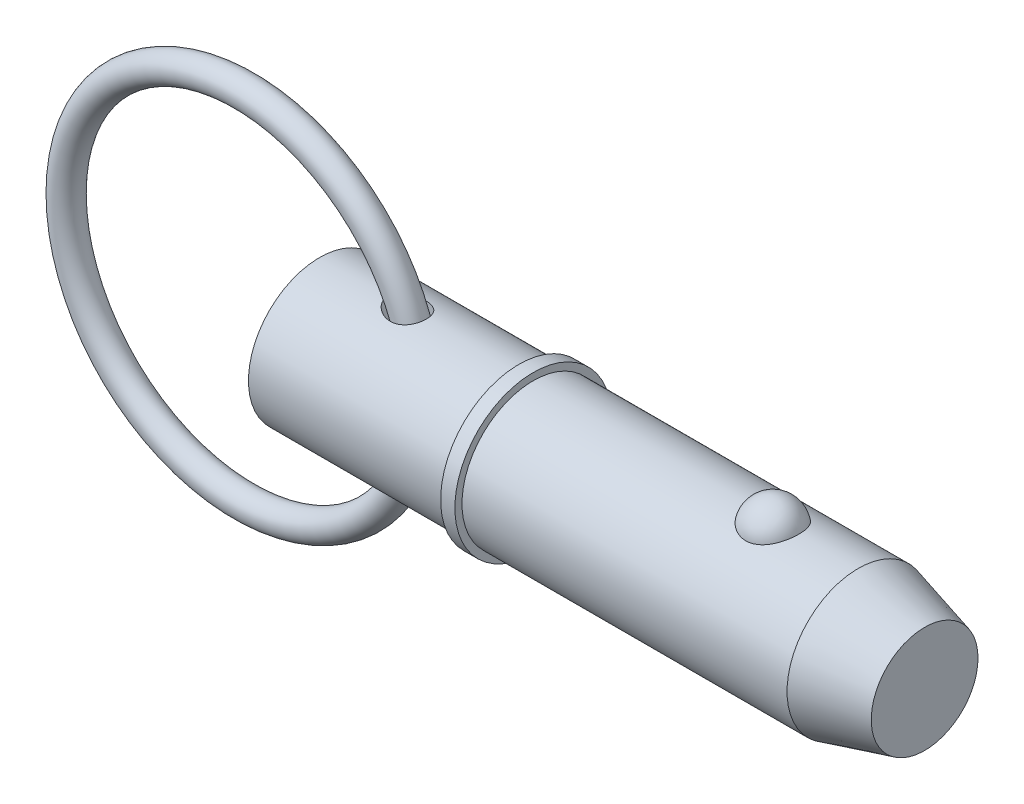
ISO-10303-21;
HEADER;
FILE_DESCRIPTION(('STEP AP214'),'2;1');
FILE_NAME('part.step','',(''),(''),'','','');
FILE_SCHEMA(('AUTOMOTIVE_DESIGN { 1 0 10303 214 1 1 1 1 }'));
ENDSEC;
DATA;
#1=APPLICATION_CONTEXT('core data for automotive mechanical design processes');
#2=APPLICATION_PROTOCOL_DEFINITION('international standard','automotive_design',2000,#1);
#3=PRODUCT_CONTEXT('',#1,'mechanical');
#4=PRODUCT('Part','Part','',(#3));
#5=PRODUCT_RELATED_PRODUCT_CATEGORY('part','',(#4));
#6=PRODUCT_DEFINITION_FORMATION('','',#4);
#7=PRODUCT_DEFINITION_CONTEXT('part definition',#1,'design');
#8=PRODUCT_DEFINITION('design','',#6,#7);
#9=PRODUCT_DEFINITION_SHAPE('','',#8);
#10=(LENGTH_UNIT() NAMED_UNIT(*) SI_UNIT(.MILLI.,.METRE.));
#11=(NAMED_UNIT(*) PLANE_ANGLE_UNIT() SI_UNIT($,.RADIAN.));
#12=(NAMED_UNIT(*) SI_UNIT($,.STERADIAN.) SOLID_ANGLE_UNIT());
#13=UNCERTAINTY_MEASURE_WITH_UNIT(LENGTH_MEASURE(1.E-05),#10,'distance_accuracy_value','');
#14=(GEOMETRIC_REPRESENTATION_CONTEXT(3) GLOBAL_UNCERTAINTY_ASSIGNED_CONTEXT((#13)) GLOBAL_UNIT_ASSIGNED_CONTEXT((#10,
#11,#12)) REPRESENTATION_CONTEXT('',''));
#15=CARTESIAN_POINT('',(0.,0.,0.));
#16=DIRECTION('',(0.,0.,1.));
#17=DIRECTION('',(1.,0.,0.));
#18=AXIS2_PLACEMENT_3D('',#15,#16,#17);
#19=CARTESIAN_POINT('',(-13.4840686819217,0.,0.));
#20=DIRECTION('',(0.,0.,1.));
#21=DIRECTION('',(1.,0.,0.));
#22=AXIS2_PLACEMENT_3D('',#19,#20,#21);
#23=TOROIDAL_SURFACE('',#22,31.75,2.54);
#24=CARTESIAN_POINT('',(20.8059313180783,0.,0.));
#25=VERTEX_POINT('',#24);
#26=VERTEX_LOOP('',#25);
#27=FACE_BOUND('',#26,.T.);
#28=ADVANCED_FACE('P0_F12',(#27),#23,.T.);
#29=CLOSED_SHELL('',(#28));
#30=MANIFOLD_SOLID_BREP('P0_B1',#29);
#31=CARTESIAN_POINT('',(0.,0.,0.));
#32=DIRECTION('',(1.,0.,0.));
#33=DIRECTION('',(0.,0.,-1.));
#34=AXIS2_PLACEMENT_3D('',#31,#32,#33);
#35=CYLINDRICAL_SURFACE('',#34,12.7);
#36=CARTESIAN_POINT('',(13.092900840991,12.5230976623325,-2.11234992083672));
#37=CARTESIAN_POINT('',(13.2535855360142,12.4976398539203,-2.26328363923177));
#38=CARTESIAN_POINT('',(13.4280602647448,12.4718592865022,-2.39955782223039));
#39=CARTESIAN_POINT('',(13.7976341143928,12.4229301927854,-2.64122157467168));
#40=CARTESIAN_POINT('',(13.9927568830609,12.3997847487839,-2.7465751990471));
#41=CARTESIAN_POINT('',(14.397672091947,12.3590534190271,-2.92439761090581));
#42=CARTESIAN_POINT('',(14.6074445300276,12.3414601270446,-2.99691026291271));
#43=CARTESIAN_POINT('',(15.0366557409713,12.3142893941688,-3.10669649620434));
#44=CARTESIAN_POINT('',(15.2560902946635,12.3047084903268,-3.14398530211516));
#45=CARTESIAN_POINT('',(15.5877843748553,12.2976819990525,-3.17128282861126));
#46=CARTESIAN_POINT('',(15.6989364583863,12.2965677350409,-3.17559470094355));
#47=CARTESIAN_POINT('',(15.9211629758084,12.2969101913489,-3.17427486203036));
#48=CARTESIAN_POINT('',(16.0322374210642,12.2983656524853,-3.16864802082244));
#49=CARTESIAN_POINT('',(16.2532861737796,12.3038832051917,-3.14715368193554));
#50=CARTESIAN_POINT('',(16.363260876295,12.3079443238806,-3.13129000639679));
#51=CARTESIAN_POINT('',(16.5810669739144,12.3185954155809,-3.08912320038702));
#52=CARTESIAN_POINT('',(16.6888986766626,12.3251850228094,-3.06282157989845));
#53=CARTESIAN_POINT('',(16.8894247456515,12.3398294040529,-3.00323791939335));
#54=CARTESIAN_POINT('',(16.9824664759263,12.3476389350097,-2.97106098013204));
#55=CARTESIAN_POINT('',(17.1651267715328,12.3648759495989,-2.89848824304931));
#56=CARTESIAN_POINT('',(17.2547457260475,12.3743032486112,-2.85809338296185));
#57=CARTESIAN_POINT('',(17.4297224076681,12.3944822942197,-2.76927391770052));
#58=CARTESIAN_POINT('',(17.5150817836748,12.40523352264,-2.72085245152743));
#59=CARTESIAN_POINT('',(17.6807665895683,12.4277046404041,-2.61629867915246));
#60=CARTESIAN_POINT('',(17.7610923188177,12.4394244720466,-2.56016683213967));
#61=CARTESIAN_POINT('',(17.9797287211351,12.4733252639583,-2.39133767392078));
#62=CARTESIAN_POINT('',(18.1114611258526,12.4961902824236,-2.27005507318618));
#63=CARTESIAN_POINT('',(18.3518677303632,12.5412050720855,-2.00648954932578));
#64=CARTESIAN_POINT('',(18.4605454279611,12.5633549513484,-1.86420981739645));
#65=CARTESIAN_POINT('',(18.6498843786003,12.6039384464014,-1.5661481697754));
#66=CARTESIAN_POINT('',(18.7311185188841,12.622444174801,-1.41073996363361));
#67=CARTESIAN_POINT('',(18.8669149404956,12.6543302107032,-1.08819514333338));
#68=CARTESIAN_POINT('',(18.921477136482,12.6677105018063,-0.921058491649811));
#69=CARTESIAN_POINT('',(19.0028875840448,12.6879542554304,-0.57902988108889));
#70=CARTESIAN_POINT('',(19.0296164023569,12.6947896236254,-0.40410783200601));
#71=CARTESIAN_POINT('',(19.0543673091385,12.7011128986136,-0.0521104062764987));
#72=CARTESIAN_POINT('',(19.0523885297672,12.7006005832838,0.124965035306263));
#73=CARTESIAN_POINT('',(19.019700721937,12.692266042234,0.476969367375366));
#74=CARTESIAN_POINT('',(18.9888798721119,12.6844153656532,0.651887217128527));
#75=CARTESIAN_POINT('',(18.8990221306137,12.6622099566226,0.99389064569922));
#76=CARTESIAN_POINT('',(18.839985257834,12.6478552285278,1.16097622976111));
#77=CARTESIAN_POINT('',(18.6951419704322,12.6142309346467,1.48231767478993));
#78=CARTESIAN_POINT('',(18.6093706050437,12.5949678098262,1.63659000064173));
#79=CARTESIAN_POINT('',(18.4131352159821,12.5536490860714,1.92810749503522));
#80=CARTESIAN_POINT('',(18.3026732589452,12.5315937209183,2.06535408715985));
#81=CARTESIAN_POINT('',(18.060669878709,12.4872833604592,2.31822774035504));
#82=CARTESIAN_POINT('',(17.9292520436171,12.4650302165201,2.43397343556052));
#83=CARTESIAN_POINT('',(17.6485957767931,12.4226514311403,2.64178289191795));
#84=CARTESIAN_POINT('',(17.4993587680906,12.4025256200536,2.73384854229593));
#85=CARTESIAN_POINT('',(17.1869531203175,12.3664726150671,2.8925825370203));
#86=CARTESIAN_POINT('',(17.0237450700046,12.3505578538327,2.95917592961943));
#87=CARTESIAN_POINT('',(16.6884731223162,12.3245177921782,3.06582547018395));
#88=CARTESIAN_POINT('',(16.516407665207,12.3143935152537,3.10587692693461));
#89=CARTESIAN_POINT('',(16.1604213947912,12.3003788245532,3.16093927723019));
#90=CARTESIAN_POINT('',(15.9763106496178,12.2967791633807,3.17478342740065));
#91=CARTESIAN_POINT('',(15.6080973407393,12.2966663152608,3.1752118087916));
#92=CARTESIAN_POINT('',(15.4239948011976,12.3001555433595,3.16178674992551));
#93=CARTESIAN_POINT('',(15.0417156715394,12.3141744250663,3.10676725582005));
#94=CARTESIAN_POINT('',(14.8439465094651,12.3253658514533,3.06251977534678));
#95=CARTESIAN_POINT('',(14.4574652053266,12.3538942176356,2.94531863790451));
#96=CARTESIAN_POINT('',(14.2687614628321,12.3712367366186,2.87233891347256));
#97=CARTESIAN_POINT('',(13.8856104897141,12.4121323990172,2.69045747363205));
#98=CARTESIAN_POINT('',(13.6926012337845,12.4361434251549,2.57861276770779));
#99=CARTESIAN_POINT('',(13.328588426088,12.4862632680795,2.32379935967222));
#100=CARTESIAN_POINT('',(13.1575718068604,12.5123708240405,2.18084927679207));
#101=CARTESIAN_POINT('',(12.8776146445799,12.5579467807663,1.89840233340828));
#102=CARTESIAN_POINT('',(12.7631663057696,12.5776642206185,1.76440341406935));
#103=CARTESIAN_POINT('',(12.5574911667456,12.6143643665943,1.47931295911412));
#104=CARTESIAN_POINT('',(12.4662309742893,12.6313509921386,1.32824646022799));
#105=CARTESIAN_POINT('',(12.3240650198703,12.6583901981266,1.03598403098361));
#106=CARTESIAN_POINT('',(12.2691183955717,12.6691064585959,0.89682285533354));
#107=CARTESIAN_POINT('',(12.1828741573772,12.6860954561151,0.611068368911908));
#108=CARTESIAN_POINT('',(12.1515620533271,12.6923709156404,0.464479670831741));
#109=CARTESIAN_POINT('',(12.1147168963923,12.6997676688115,0.167420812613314));
#110=CARTESIAN_POINT('',(12.109270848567,12.7008715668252,0.0169392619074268));
#111=CARTESIAN_POINT('',(12.1248234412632,12.6977391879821,-0.282592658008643));
#112=CARTESIAN_POINT('',(12.1458245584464,12.6935024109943,-0.431642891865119));
#113=CARTESIAN_POINT('',(12.210908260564,12.6805581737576,-0.716008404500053));
#114=CARTESIAN_POINT('',(12.2537133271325,12.6720986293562,-0.851633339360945));
#115=CARTESIAN_POINT('',(12.3591295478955,12.6516826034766,-1.11460776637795));
#116=CARTESIAN_POINT('',(12.4217455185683,12.6397252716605,-1.24195523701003));
#117=CARTESIAN_POINT('',(12.5735635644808,12.61152213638,-1.50300095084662));
#118=CARTESIAN_POINT('',(12.6652159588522,12.5949150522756,-1.63522875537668));
#119=CARTESIAN_POINT('',(12.8664347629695,12.5599626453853,-1.88501670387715));
#120=CARTESIAN_POINT('',(12.9760196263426,12.541615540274,-2.00256151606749));
#121=CARTESIAN_POINT('',(13.092900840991,12.5230976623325,-2.11234992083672));
#122=B_SPLINE_CURVE_WITH_KNOTS('',3,(#36,#37,#38,#39,#40,#41,#42,#43,#44,#45,#46,#47,#48,#49,
#50,#51,#52,#53,#54,#55,#56,#57,#58,#59,#60,#61,#62,#63,#64,#65,#66,#67,#68,#69,#70,#71,#72,#73,
#74,#75,#76,#77,#78,#79,#80,#81,#82,#83,#84,#85,#86,#87,#88,#89,#90,#91,#92,#93,#94,#95,#96,#97,
#98,#99,#100,#101,#102,#103,#104,#105,#106,#107,#108,#109,#110,#111,#112,#113,#114,#115,#116,
#117,#118,#119,#120,#121),.UNSPECIFIED.,.T.,.F.,(4,2,2,2,2,2,2,2,2,2,2,2,2,2,2,2,2,2,2,2,2,2,2,
2,2,2,2,2,2,2,2,2,2,2,2,2,2,2,2,2,2,2,4),(0.,0.665132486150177,1.33103515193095,
1.99604575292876,2.66076878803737,2.99410229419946,3.32727250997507,3.66031840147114,
3.99331613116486,4.28918991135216,4.58502994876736,4.88075456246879,5.17646157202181,
5.71510826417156,6.25367317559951,6.78017774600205,7.30668400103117,7.83544030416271,
8.36421259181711,8.89504347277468,9.42587399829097,9.95601150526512,10.4861046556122,
11.0131799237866,11.54021312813,12.0687854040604,12.597451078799,13.1491450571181,
13.7010270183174,14.3074556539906,14.914435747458,15.5844380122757,16.2540403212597,
16.7839879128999,17.3131679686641,17.7612578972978,18.2090728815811,18.658393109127,
19.1077554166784,19.5333866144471,19.959121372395,20.4424347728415,20.9262486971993),.UNSPECIFIED.);
#123=CARTESIAN_POINT('',(13.092900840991,12.5230976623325,-2.11234992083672));
#124=VERTEX_POINT('',#123);
#125=EDGE_CURVE('P1_E42',#124,#124,#122,.T.);
#126=ORIENTED_EDGE('',*,*,#125,.T.);
#127=EDGE_LOOP('',(#126));
#128=FACE_BOUND('',#127,.T.);
#129=CARTESIAN_POINT('',(0.,0.,0.));
#130=DIRECTION('',(1.,0.,0.));
#131=DIRECTION('',(0.,0.,-1.));
#132=AXIS2_PLACEMENT_3D('',#129,#130,#131);
#133=CIRCLE('',#132,12.7);
#134=CARTESIAN_POINT('',(0.,0.,-12.7));
#135=VERTEX_POINT('',#134);
#136=EDGE_CURVE('P1_E9',#135,#135,#133,.T.);
#137=ORIENTED_EDGE('',*,*,#136,.T.);
#138=EDGE_LOOP('',(#137));
#139=FACE_BOUND('',#138,.T.);
#140=CARTESIAN_POINT('',(35.56,0.,0.));
#141=DIRECTION('',(1.,0.,0.));
#142=DIRECTION('',(0.,0.,-1.));
#143=AXIS2_PLACEMENT_3D('',#140,#141,#142);
#144=CIRCLE('',#143,12.7);
#145=CARTESIAN_POINT('',(35.56,0.,-12.7));
#146=VERTEX_POINT('',#145);
#147=EDGE_CURVE('P1_E25',#146,#146,#144,.T.);
#148=ORIENTED_EDGE('',*,*,#147,.F.);
#149=EDGE_LOOP('',(#148));
#150=FACE_BOUND('',#149,.T.);
#151=CARTESIAN_POINT('',(13.092900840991,-12.5230976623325,-2.11234992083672));
#152=CARTESIAN_POINT('',(12.9659872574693,-12.5432050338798,-1.99314161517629));
#153=CARTESIAN_POINT('',(12.847667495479,-12.5631124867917,-1.86478966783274));
#154=CARTESIAN_POINT('',(12.6324721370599,-12.6007427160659,-1.59069749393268));
#155=CARTESIAN_POINT('',(12.5355833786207,-12.6184668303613,-1.444968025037));
#156=CARTESIAN_POINT('',(12.4099071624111,-12.642034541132,-1.21450950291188));
#157=CARTESIAN_POINT('',(12.3711427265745,-12.6494175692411,-1.13527163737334));
#158=CARTESIAN_POINT('',(12.3010994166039,-12.6628962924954,-0.973464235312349));
#159=CARTESIAN_POINT('',(12.2698164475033,-12.6689926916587,-0.890896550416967));
#160=CARTESIAN_POINT('',(12.2153933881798,-12.6796767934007,-0.72309085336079));
#161=CARTESIAN_POINT('',(12.192246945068,-12.6842656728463,-0.637854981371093));
#162=CARTESIAN_POINT('',(12.154603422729,-12.6917620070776,-0.465421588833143));
#163=CARTESIAN_POINT('',(12.1401047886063,-12.69466976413,-0.378224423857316));
#164=CARTESIAN_POINT('',(12.1214471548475,-12.6984180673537,-0.214417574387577));
#165=CARTESIAN_POINT('',(12.1161713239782,-12.699481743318,-0.13793855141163));
#166=CARTESIAN_POINT('',(12.1124989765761,-12.7002217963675,0.0152189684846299));
#167=CARTESIAN_POINT('',(12.1141046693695,-12.6998977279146,0.0918975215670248));
#168=CARTESIAN_POINT('',(12.1241695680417,-12.6978712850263,0.244746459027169));
#169=CARTESIAN_POINT('',(12.132625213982,-12.6961696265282,0.320917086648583));
#170=CARTESIAN_POINT('',(12.1562110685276,-12.6914452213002,0.472185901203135));
#171=CARTESIAN_POINT('',(12.1713438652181,-12.6884219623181,0.547283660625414));
#172=CARTESIAN_POINT('',(12.223731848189,-12.6780227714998,0.759415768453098));
#173=CARTESIAN_POINT('',(12.268839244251,-12.6691353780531,0.894507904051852));
#174=CARTESIAN_POINT('',(12.3786059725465,-12.6479567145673,1.1560647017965));
#175=CARTESIAN_POINT('',(12.4432700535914,-12.6356646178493,1.28252725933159));
#176=CARTESIAN_POINT('',(12.5971341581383,-12.607236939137,1.5381272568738));
#177=CARTESIAN_POINT('',(12.6882234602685,-12.5908303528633,1.66609325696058));
#178=CARTESIAN_POINT('',(12.887209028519,-12.5564642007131,1.90792082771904));
#179=CARTESIAN_POINT('',(12.995115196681,-12.5385037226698,2.02177401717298));
#180=CARTESIAN_POINT('',(13.2471335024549,-12.4987806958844,2.25547266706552));
#181=CARTESIAN_POINT('',(13.3941979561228,-12.4769622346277,2.3721269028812));
#182=CARTESIAN_POINT('',(13.7036983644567,-12.4349587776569,2.58329351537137));
#183=CARTESIAN_POINT('',(13.8661464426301,-12.4147750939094,2.67778822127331));
#184=CARTESIAN_POINT('',(14.2306024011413,-12.3748157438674,2.85722657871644));
#185=CARTESIAN_POINT('',(14.4347220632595,-12.3556533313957,2.93804226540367));
#186=CARTESIAN_POINT('',(14.8540416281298,-12.3245430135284,3.06594877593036));
#187=CARTESIAN_POINT('',(15.0692453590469,-12.3125976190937,3.11302786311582));
#188=CARTESIAN_POINT('',(15.3981213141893,-12.3014943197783,3.15648626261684));
#189=CARTESIAN_POINT('',(15.5100235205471,-12.298940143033,3.16639841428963));
#190=CARTESIAN_POINT('',(15.7342812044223,-12.2963942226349,3.17627668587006));
#191=CARTESIAN_POINT('',(15.8466364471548,-12.2964012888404,3.17624742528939));
#192=CARTESIAN_POINT('',(16.0707903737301,-12.2990694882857,3.16589868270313));
#193=CARTESIAN_POINT('',(16.1825892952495,-12.3017293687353,3.1555840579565));
#194=CARTESIAN_POINT('',(16.4046123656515,-12.3096862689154,3.12440163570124));
#195=CARTESIAN_POINT('',(16.514836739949,-12.314982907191,3.10353536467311));
#196=CARTESIAN_POINT('',(16.7211934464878,-12.3273933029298,3.05384263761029));
#197=CARTESIAN_POINT('',(16.8175961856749,-12.3342598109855,3.0260738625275));
#198=CARTESIAN_POINT('',(17.0073515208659,-12.3498131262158,2.96195947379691));
#199=CARTESIAN_POINT('',(17.100704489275,-12.3584997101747,2.92561491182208));
#200=CARTESIAN_POINT('',(17.2834584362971,-12.3774243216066,2.84448580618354));
#201=CARTESIAN_POINT('',(17.3728610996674,-12.3876616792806,2.79970490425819));
#202=CARTESIAN_POINT('',(17.5469061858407,-12.409352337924,2.701939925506));
#203=CARTESIAN_POINT('',(17.6315489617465,-12.4208055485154,2.64895645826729));
#204=CARTESIAN_POINT('',(17.7872886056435,-12.4433734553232,2.54070972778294));
#205=CARTESIAN_POINT('',(17.8589017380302,-12.4544123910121,2.4861716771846));
#206=CARTESIAN_POINT('',(17.9970802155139,-12.4768404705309,2.37105291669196));
#207=CARTESIAN_POINT('',(18.063643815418,-12.4882297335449,2.31047013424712));
#208=CARTESIAN_POINT('',(18.1911677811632,-12.5110137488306,2.18372894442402));
#209=CARTESIAN_POINT('',(18.2521311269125,-12.5224084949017,2.11757353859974));
#210=CARTESIAN_POINT('',(18.3680676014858,-12.5448751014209,1.98014449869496));
#211=CARTESIAN_POINT('',(18.4230385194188,-12.5559468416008,1.90886899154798));
#212=CARTESIAN_POINT('',(18.5752306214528,-12.5875288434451,1.6925769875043));
#213=CARTESIAN_POINT('',(18.6637018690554,-12.6071482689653,1.54111740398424));
#214=CARTESIAN_POINT('',(18.8143485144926,-12.6417556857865,1.225260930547));
#215=CARTESIAN_POINT('',(18.876524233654,-12.6567437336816,1.06086419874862));
#216=CARTESIAN_POINT('',(18.9733884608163,-12.6805238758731,0.723195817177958));
#217=CARTESIAN_POINT('',(19.0079967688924,-12.6892978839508,0.549899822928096));
#218=CARTESIAN_POINT('',(19.0486500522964,-12.6996362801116,0.199781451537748));
#219=CARTESIAN_POINT('',(19.054694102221,-12.7012004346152,0.0229589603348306));
#220=CARTESIAN_POINT('',(19.0380549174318,-12.6969431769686,-0.330044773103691));
#221=CARTESIAN_POINT('',(19.0152419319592,-12.6910884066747,-0.506219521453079));
#222=CARTESIAN_POINT('',(18.9411599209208,-12.672565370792,-0.852112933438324));
#223=CARTESIAN_POINT('',(18.8898907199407,-12.659897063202,-1.0218315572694));
#224=CARTESIAN_POINT('',(18.7600888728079,-12.6291327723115,-1.34987035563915));
#225=CARTESIAN_POINT('',(18.6815715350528,-12.6110398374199,-1.50819687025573));
#226=CARTESIAN_POINT('',(18.4991526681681,-12.5714188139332,-1.808997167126));
#227=CARTESIAN_POINT('',(18.3952529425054,-12.5498909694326,-1.95147207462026));
#228=CARTESIAN_POINT('',(18.1653806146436,-12.5059234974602,-2.21580059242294));
#229=CARTESIAN_POINT('',(18.0395297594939,-12.4834893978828,-2.33776101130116));
#230=CARTESIAN_POINT('',(17.7688701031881,-12.4400863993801,-2.55870399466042));
#231=CARTESIAN_POINT('',(17.624063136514,-12.4191173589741,-2.65768878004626));
#232=CARTESIAN_POINT('',(17.3196803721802,-12.380896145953,-2.8304192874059));
#233=CARTESIAN_POINT('',(17.1601036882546,-12.3636441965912,-2.90416349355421));
#234=CARTESIAN_POINT('',(16.8308162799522,-12.3345597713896,-3.02531546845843));
#235=CARTESIAN_POINT('',(16.6611041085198,-12.322728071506,-3.07271946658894));
#236=CARTESIAN_POINT('',(16.3099674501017,-12.3051318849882,-3.14246490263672));
#237=CARTESIAN_POINT('',(16.1283412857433,-12.2996014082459,-3.16384159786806));
#238=CARTESIAN_POINT('',(15.7639014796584,-12.2955807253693,-3.17942379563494));
#239=CARTESIAN_POINT('',(15.5810875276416,-12.2970924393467,-3.17362188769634));
#240=CARTESIAN_POINT('',(15.20154276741,-12.307074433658,-3.13470416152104));
#241=CARTESIAN_POINT('',(15.0050835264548,-12.316173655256,-3.09911848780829));
#242=CARTESIAN_POINT('',(14.6197996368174,-12.3407987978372,-2.99954607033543));
#243=CARTESIAN_POINT('',(14.4309834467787,-12.3563316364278,-2.93552875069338));
#244=CARTESIAN_POINT('',(14.0353751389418,-12.3949378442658,-2.76840280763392));
#245=CARTESIAN_POINT('',(13.8306109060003,-12.4188242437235,-2.66064798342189));
#246=CARTESIAN_POINT('',(13.4432099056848,-12.4696241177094,-2.4113475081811));
#247=CARTESIAN_POINT('',(13.2605568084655,-12.4965353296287,-2.26982702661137));
#248=CARTESIAN_POINT('',(13.092900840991,-12.5230976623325,-2.11234992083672));
#249=B_SPLINE_CURVE_WITH_KNOTS('',3,(#151,#152,#153,#154,#155,#156,#157,#158,#159,#160,#161,
#162,#163,#164,#165,#166,#167,#168,#169,#170,#171,#172,#173,#174,#175,#176,#177,#178,#179,#180,
#181,#182,#183,#184,#185,#186,#187,#188,#189,#190,#191,#192,#193,#194,#195,#196,#197,#198,#199,
#200,#201,#202,#203,#204,#205,#206,#207,#208,#209,#210,#211,#212,#213,#214,#215,#216,#217,#218,
#219,#220,#221,#222,#223,#224,#225,#226,#227,#228,#229,#230,#231,#232,#233,#234,#235,#236,#237,
#238,#239,#240,#241,#242,#243,#244,#245,#246,#247,#248),.UNSPECIFIED.,.T.,.F.,(4,2,2,2,2,2,2,2,
2,2,2,2,2,2,2,2,2,2,2,2,2,2,2,2,2,2,2,2,2,2,2,2,2,2,2,2,2,2,2,2,2,2,2,2,2,2,2,2,4),(0.,
0.525289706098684,1.05025590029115,1.31549608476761,1.58059075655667,1.84547798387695,
2.11031756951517,2.34000998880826,2.56977615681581,2.79942299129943,3.0291589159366,
3.45531787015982,3.8815803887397,4.35362362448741,4.82594586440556,5.39074449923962,
5.95599200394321,6.61421946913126,7.27267581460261,7.60939383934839,7.94595540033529,
8.2823580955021,8.61871213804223,8.91997243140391,9.22119579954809,9.52228943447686,
9.82336070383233,10.0950952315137,10.3669232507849,10.6386057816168,10.9103882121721,
11.4371688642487,11.9639430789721,12.4922442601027,13.0205625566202,13.5512648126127,
14.0819703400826,14.6123781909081,15.1427483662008,15.6702654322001,16.1977314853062,
16.7252292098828,17.2528024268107,17.7993878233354,18.3461222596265,18.9432829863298,
19.5410874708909,20.2355241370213,20.9294447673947),.UNSPECIFIED.);
#250=CARTESIAN_POINT('',(13.092900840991,-12.5230976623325,-2.11234992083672));
#251=VERTEX_POINT('',#250);
#252=EDGE_CURVE('P1_E17',#251,#251,#249,.T.);
#253=ORIENTED_EDGE('',*,*,#252,.T.);
#254=EDGE_LOOP('',(#253));
#255=FACE_BOUND('',#254,.T.);
#256=ADVANCED_FACE('P1_F13',(#128,#139,#150,#255),#35,.T.);
#257=CARTESIAN_POINT('',(0.,0.,0.));
#258=DIRECTION('',(1.,0.,0.));
#259=DIRECTION('',(0.,0.,-1.));
#260=AXIS2_PLACEMENT_3D('',#257,#258,#259);
#261=CYLINDRICAL_SURFACE('',#260,12.7);
#262=CARTESIAN_POINT('',(96.1007386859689,0.,0.));
#263=DIRECTION('',(1.,0.,0.));
#264=DIRECTION('',(0.,0.,-1.));
#265=AXIS2_PLACEMENT_3D('',#262,#263,#264);
#266=CIRCLE('',#265,12.7);
#267=CARTESIAN_POINT('',(96.1007386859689,0.,-12.7));
#268=VERTEX_POINT('',#267);
#269=EDGE_CURVE('P1_E99',#268,#268,#266,.T.);
#270=ORIENTED_EDGE('',*,*,#269,.F.);
#271=EDGE_LOOP('',(#270));
#272=FACE_BOUND('',#271,.T.);
#273=CARTESIAN_POINT('',(38.1,0.,0.));
#274=DIRECTION('',(1.,0.,0.));
#275=DIRECTION('',(0.,0.,-1.));
#276=AXIS2_PLACEMENT_3D('',#273,#274,#275);
#277=CIRCLE('',#276,12.7);
#278=CARTESIAN_POINT('',(38.1,0.,-12.7));
#279=VERTEX_POINT('',#278);
#280=EDGE_CURVE('P1_E96',#279,#279,#277,.T.);
#281=ORIENTED_EDGE('',*,*,#280,.T.);
#282=EDGE_LOOP('',(#281));
#283=FACE_BOUND('',#282,.T.);
#284=CARTESIAN_POINT('',(80.8600429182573,11.7500437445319,4.8193850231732));
#285=CARTESIAN_POINT('',(80.7350881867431,11.7500430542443,4.81938571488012));
#286=CARTESIAN_POINT('',(80.610144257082,11.7520975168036,4.81438658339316));
#287=CARTESIAN_POINT('',(80.3611425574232,11.760253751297,4.79442904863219));
#288=CARTESIAN_POINT('',(80.2370850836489,11.7663568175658,4.77946746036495));
#289=CARTESIAN_POINT('',(79.9909016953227,11.7824262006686,4.73971414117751));
#290=CARTESIAN_POINT('',(79.8687744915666,11.7923898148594,4.7149292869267));
#291=CARTESIAN_POINT('',(79.6271874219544,11.8158938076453,4.65571340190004));
#292=CARTESIAN_POINT('',(79.5077285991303,11.8294355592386,4.62127866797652));
#293=CARTESIAN_POINT('',(79.2725578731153,11.8596812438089,4.54309502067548));
#294=CARTESIAN_POINT('',(79.1568393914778,11.8763792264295,4.4993636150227));
#295=CARTESIAN_POINT('',(78.9296530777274,11.9124878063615,4.40287235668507));
#296=CARTESIAN_POINT('',(78.8181868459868,11.9318994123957,4.35010914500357));
#297=CARTESIAN_POINT('',(78.4912782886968,11.9934256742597,4.17881316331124));
#298=CARTESIAN_POINT('',(78.2831270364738,12.038858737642,4.04720756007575));
#299=CARTESIAN_POINT('',(77.8858509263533,12.1352173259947,3.74856446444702));
#300=CARTESIAN_POINT('',(77.6974438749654,12.1862630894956,3.58061821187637));
#301=CARTESIAN_POINT('',(77.3505213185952,12.2875163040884,3.21600758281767));
#302=CARTESIAN_POINT('',(77.1920113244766,12.3377235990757,3.01933792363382));
#303=CARTESIAN_POINT('',(76.9016887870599,12.434492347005,2.59291655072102));
#304=CARTESIAN_POINT('',(76.7713762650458,12.4807925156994,2.36208286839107));
#305=CARTESIAN_POINT('',(76.5494079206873,12.5623454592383,1.88070399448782));
#306=CARTESIAN_POINT('',(76.4577554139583,12.5975972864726,1.63015711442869));
#307=CARTESIAN_POINT('',(76.3140466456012,12.6538414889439,1.11298869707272));
#308=CARTESIAN_POINT('',(76.2624990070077,12.6746503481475,0.846205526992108));
#309=CARTESIAN_POINT('',(76.2019771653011,12.699153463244,0.3070854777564));
#310=CARTESIAN_POINT('',(76.1930018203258,12.7028481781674,0.0347487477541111));
#311=CARTESIAN_POINT('',(76.2177310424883,12.6927785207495,-0.506073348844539));
#312=CARTESIAN_POINT('',(76.2511899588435,12.6791146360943,-0.774571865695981));
#313=CARTESIAN_POINT('',(76.3596877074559,12.635882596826,-1.3017024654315));
#314=CARTESIAN_POINT('',(76.4347272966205,12.6063141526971,-1.56033436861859));
#315=CARTESIAN_POINT('',(76.6250000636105,12.5342328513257,-2.06083899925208));
#316=CARTESIAN_POINT('',(76.7402872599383,12.4917026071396,-2.3026886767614));
#317=CARTESIAN_POINT('',(77.0087044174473,12.3981123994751,-2.76259600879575));
#318=CARTESIAN_POINT('',(77.1618374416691,12.3470517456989,-2.98065173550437));
#319=CARTESIAN_POINT('',(77.5035077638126,12.2416045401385,-3.38786328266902));
#320=CARTESIAN_POINT('',(77.6922017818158,12.1872040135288,-3.57688418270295));
#321=CARTESIAN_POINT('',(78.1002392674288,12.0814086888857,-3.91941073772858));
#322=CARTESIAN_POINT('',(78.3195800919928,12.0300136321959,-4.07291945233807));
#323=CARTESIAN_POINT('',(78.778375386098,11.9373542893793,-4.33691289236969));
#324=CARTESIAN_POINT('',(79.0173044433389,11.8958982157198,-4.44824125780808));
#325=CARTESIAN_POINT('',(79.5124376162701,11.8268116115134,-4.62881985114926));
#326=CARTESIAN_POINT('',(79.7686351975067,11.7991758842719,-4.69808589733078));
#327=CARTESIAN_POINT('',(80.2771640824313,11.7622209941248,-4.78983181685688));
#328=CARTESIAN_POINT('',(80.5290414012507,11.7520502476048,-4.81449025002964));
#329=CARTESIAN_POINT('',(81.0335734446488,11.7485796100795,-4.82295735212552));
#330=CARTESIAN_POINT('',(81.2862280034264,11.7552763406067,-4.80677420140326));
#331=CARTESIAN_POINT('',(81.7768341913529,11.7842584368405,-4.73525430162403));
#332=CARTESIAN_POINT('',(82.0149984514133,11.8060486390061,-4.68116061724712));
#333=CARTESIAN_POINT('',(82.4784894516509,11.8622750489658,-4.53678133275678));
#334=CARTESIAN_POINT('',(82.7038151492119,11.8967122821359,-4.44649279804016));
#335=CARTESIAN_POINT('',(83.1408018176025,11.9754603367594,-4.22987613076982));
#336=CARTESIAN_POINT('',(83.3520579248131,12.0199699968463,-4.10280539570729));
#337=CARTESIAN_POINT('',(83.7506012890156,12.1138028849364,-3.81685409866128));
#338=CARTESIAN_POINT('',(83.9378830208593,12.163127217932,-3.65796622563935));
#339=CARTESIAN_POINT('',(84.2933509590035,12.2642343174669,-3.30364864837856));
#340=CARTESIAN_POINT('',(84.4601119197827,12.3160165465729,-3.10678783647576));
#341=CARTESIAN_POINT('',(84.7595799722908,12.4142566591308,-2.68748409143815));
#342=CARTESIAN_POINT('',(84.8922809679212,12.4607135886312,-2.46503658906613));
#343=CARTESIAN_POINT('',(85.1246912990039,12.5450236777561,-1.99289519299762));
#344=CARTESIAN_POINT('',(85.223215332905,12.5825557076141,-1.74255918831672));
#345=CARTESIAN_POINT('',(85.3792277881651,12.6431720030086,-1.22773734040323));
#346=CARTESIAN_POINT('',(85.4367157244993,12.6662560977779,-0.963251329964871));
#347=CARTESIAN_POINT('',(85.5095441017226,12.6956486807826,-0.427355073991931));
#348=CARTESIAN_POINT('',(85.5248378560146,12.7019385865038,-0.155937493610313));
#349=CARTESIAN_POINT('',(85.5127794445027,12.6970201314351,0.385928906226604));
#350=CARTESIAN_POINT('',(85.4854280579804,12.6858120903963,0.656377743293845));
#351=CARTESIAN_POINT('',(85.4130609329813,12.6568455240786,1.0545401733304));
#352=CARTESIAN_POINT('',(85.3837963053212,12.6451962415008,1.18577850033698));
#353=CARTESIAN_POINT('',(85.3150228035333,12.6181819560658,1.44513808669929));
#354=CARTESIAN_POINT('',(85.2755176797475,12.6028183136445,1.57326046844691));
#355=CARTESIAN_POINT('',(85.1864397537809,12.5687547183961,1.82554978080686));
#356=CARTESIAN_POINT('',(85.1368627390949,12.5500533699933,1.94971503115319));
#357=CARTESIAN_POINT('',(85.0279211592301,12.5098093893,2.1931437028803));
#358=CARTESIAN_POINT('',(84.9685601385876,12.4882677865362,2.31240887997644));
#359=CARTESIAN_POINT('',(84.8399712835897,12.4427679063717,2.54593031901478));
#360=CARTESIAN_POINT('',(84.7706888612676,12.4187964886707,2.66015396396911));
#361=CARTESIAN_POINT('',(84.622903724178,12.3691892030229,2.88202659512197));
#362=CARTESIAN_POINT('',(84.5444044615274,12.3435539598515,2.98967802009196));
#363=CARTESIAN_POINT('',(84.3785502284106,12.2912955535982,3.19774385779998));
#364=CARTESIAN_POINT('',(84.2911918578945,12.2646720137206,3.29815546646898));
#365=CARTESIAN_POINT('',(84.1081617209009,12.2111945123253,3.49095035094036));
#366=CARTESIAN_POINT('',(84.0124932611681,12.1843406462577,3.58333679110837));
#367=CARTESIAN_POINT('',(83.8136272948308,12.1312249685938,3.75922876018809));
#368=CARTESIAN_POINT('',(83.7104503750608,12.104961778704,3.84275713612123));
#369=CARTESIAN_POINT('',(83.4970133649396,12.0537284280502,4.00056406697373));
#370=CARTESIAN_POINT('',(83.3867562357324,12.028757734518,4.07484645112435));
#371=CARTESIAN_POINT('',(83.1597550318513,11.9808306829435,4.21367959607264));
#372=CARTESIAN_POINT('',(83.0430068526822,11.9578756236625,4.27822410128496));
#373=CARTESIAN_POINT('',(82.8039425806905,11.9147184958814,4.39698483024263));
#374=CARTESIAN_POINT('',(82.6816287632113,11.894515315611,4.45120522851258));
#375=CARTESIAN_POINT('',(82.4229527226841,11.8561129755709,4.55255353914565));
#376=CARTESIAN_POINT('',(82.2862237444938,11.8381764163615,4.59884858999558));
#377=CARTESIAN_POINT('',(82.0086087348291,11.8069093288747,4.67853897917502));
#378=CARTESIAN_POINT('',(81.8677245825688,11.7935767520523,4.71194005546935));
#379=CARTESIAN_POINT('',(81.5830944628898,11.7720277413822,4.76552188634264));
#380=CARTESIAN_POINT('',(81.4393488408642,11.7638106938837,4.78570422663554));
#381=CARTESIAN_POINT('',(81.1504114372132,11.7528195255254,4.8126343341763));
#382=CARTESIAN_POINT('',(81.0052198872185,11.7500445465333,4.81938421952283));
#383=CARTESIAN_POINT('',(80.8600429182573,11.7500437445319,4.8193850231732));
#384=B_SPLINE_CURVE_WITH_KNOTS('',3,(#284,#285,#286,#287,#288,#289,#290,#291,#292,#293,#294,
#295,#296,#297,#298,#299,#300,#301,#302,#303,#304,#305,#306,#307,#308,#309,#310,#311,#312,#313,
#314,#315,#316,#317,#318,#319,#320,#321,#322,#323,#324,#325,#326,#327,#328,#329,#330,#331,#332,
#333,#334,#335,#336,#337,#338,#339,#340,#341,#342,#343,#344,#345,#346,#347,#348,#349,#350,#351,
#352,#353,#354,#355,#356,#357,#358,#359,#360,#361,#362,#363,#364,#365,#366,#367,#368,#369,#370,
#371,#372,#373,#374,#375,#376,#377,#378,#379,#380,#381,#382,#383),.UNSPECIFIED.,.T.,.F.,(4,2,2,
2,2,2,2,2,2,2,2,2,2,2,2,2,2,2,2,2,2,2,2,2,2,2,2,2,2,2,2,2,2,2,2,2,2,2,2,2,2,2,2,2,2,2,2,2,2,4),
(0.,0.374729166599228,0.749578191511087,1.12416526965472,1.49889629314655,1.87292776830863,
2.24709865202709,2.99481328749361,3.76399449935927,4.53331735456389,5.3368391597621,
6.14042986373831,6.95405296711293,7.7676542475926,8.57656703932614,9.38549455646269,
10.1955119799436,11.0055949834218,11.8193353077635,12.6330054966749,13.4294141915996,
14.2255231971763,14.9815786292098,15.7374826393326,16.4696948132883,17.2019663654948,
17.9501979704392,18.6986017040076,19.4844704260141,20.2704797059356,21.0815215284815,
21.8925729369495,22.70452139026,23.5164550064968,23.9209608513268,24.3253187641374,
24.7298461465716,25.1342272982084,25.5409255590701,25.947471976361,26.3541750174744,
26.7607169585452,27.166183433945,27.5714814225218,27.9770386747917,28.3824315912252,
28.8181206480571,29.2536155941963,29.6890582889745,30.1244323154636),.UNSPECIFIED.);
#385=CARTESIAN_POINT('',(80.8600429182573,11.7500437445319,4.8193850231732));
#386=VERTEX_POINT('',#385);
#387=EDGE_CURVE('P1_E34',#386,#386,#384,.T.);
#388=ORIENTED_EDGE('',*,*,#387,.T.);
#389=EDGE_LOOP('',(#388));
#390=FACE_BOUND('',#389,.T.);
#391=ADVANCED_FACE('P1_F46',(#272,#283,#390),#261,.T.);
#392=CARTESIAN_POINT('',(0.,0.,0.));
#393=DIRECTION('',(-1.,0.,0.));
#394=DIRECTION('',(0.,0.,1.));
#395=AXIS2_PLACEMENT_3D('',#392,#393,#394);
#396=PLANE('',#395);
#397=ORIENTED_EDGE('',*,*,#136,.F.);
#398=EDGE_LOOP('',(#397));
#399=FACE_BOUND('',#398,.T.);
#400=ADVANCED_FACE('P1_F15',(#399),#396,.T.);
#401=CARTESIAN_POINT('',(35.56,12.7,0.));
#402=DIRECTION('',(-1.,0.,0.));
#403=DIRECTION('',(0.,0.,1.));
#404=AXIS2_PLACEMENT_3D('',#401,#402,#403);
#405=PLANE('',#404);
#406=ORIENTED_EDGE('',*,*,#147,.T.);
#407=EDGE_LOOP('',(#406));
#408=FACE_BOUND('',#407,.T.);
#409=CARTESIAN_POINT('',(35.56,0.,0.));
#410=DIRECTION('',(1.,0.,0.));
#411=DIRECTION('',(0.,0.,-1.));
#412=AXIS2_PLACEMENT_3D('',#409,#410,#411);
#413=CIRCLE('',#412,13.97);
#414=CARTESIAN_POINT('',(35.56,0.,-13.97));
#415=VERTEX_POINT('',#414);
#416=EDGE_CURVE('P1_E30',#415,#415,#413,.T.);
#417=ORIENTED_EDGE('',*,*,#416,.F.);
#418=EDGE_LOOP('',(#417));
#419=FACE_BOUND('',#418,.T.);
#420=ADVANCED_FACE('P1_F81',(#408,#419),#405,.T.);
#421=CARTESIAN_POINT('',(0.,0.,0.));
#422=DIRECTION('',(1.,0.,0.));
#423=DIRECTION('',(0.,0.,-1.));
#424=AXIS2_PLACEMENT_3D('',#421,#422,#423);
#425=CYLINDRICAL_SURFACE('',#424,13.97);
#426=ORIENTED_EDGE('',*,*,#416,.T.);
#427=EDGE_LOOP('',(#426));
#428=FACE_BOUND('',#427,.T.);
#429=CARTESIAN_POINT('',(38.1,0.,0.));
#430=DIRECTION('',(1.,0.,0.));
#431=DIRECTION('',(0.,0.,-1.));
#432=AXIS2_PLACEMENT_3D('',#429,#430,#431);
#433=CIRCLE('',#432,13.97);
#434=CARTESIAN_POINT('',(38.1,0.,-13.97));
#435=VERTEX_POINT('',#434);
#436=EDGE_CURVE('P1_E95',#435,#435,#433,.T.);
#437=ORIENTED_EDGE('',*,*,#436,.F.);
#438=EDGE_LOOP('',(#437));
#439=FACE_BOUND('',#438,.T.);
#440=ADVANCED_FACE('P1_F68',(#428,#439),#425,.T.);
#441=CARTESIAN_POINT('',(38.1,13.97,0.));
#442=DIRECTION('',(1.,0.,0.));
#443=DIRECTION('',(0.,0.,-1.));
#444=AXIS2_PLACEMENT_3D('',#441,#442,#443);
#445=PLANE('',#444);
#446=ORIENTED_EDGE('',*,*,#436,.T.);
#447=EDGE_LOOP('',(#446));
#448=FACE_BOUND('',#447,.T.);
#449=ORIENTED_EDGE('',*,*,#280,.F.);
#450=EDGE_LOOP('',(#449));
#451=FACE_BOUND('',#450,.T.);
#452=ADVANCED_FACE('P1_F62',(#448,#451),#445,.T.);
#453=CARTESIAN_POINT('',(107.95,0.,0.));
#454=DIRECTION('',(-1.,0.,0.));
#455=DIRECTION('',(0.,0.,1.));
#456=AXIS2_PLACEMENT_3D('',#453,#454,#455);
#457=CONICAL_SURFACE('',#456,9.52500000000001,0.26179938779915);
#458=ORIENTED_EDGE('',*,*,#269,.T.);
#459=EDGE_LOOP('',(#458));
#460=FACE_BOUND('',#459,.T.);
#461=CARTESIAN_POINT('',(107.95,0.,0.));
#462=DIRECTION('',(1.,0.,0.));
#463=DIRECTION('',(0.,0.,-1.));
#464=AXIS2_PLACEMENT_3D('',#461,#462,#463);
#465=CIRCLE('',#464,9.52500000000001);
#466=CARTESIAN_POINT('',(107.95,0.,-9.52500000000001));
#467=VERTEX_POINT('',#466);
#468=EDGE_CURVE('P1_E41',#467,#467,#465,.T.);
#469=ORIENTED_EDGE('',*,*,#468,.F.);
#470=EDGE_LOOP('',(#469));
#471=FACE_BOUND('',#470,.T.);
#472=ADVANCED_FACE('P1_F59',(#460,#471),#457,.T.);
#473=CARTESIAN_POINT('',(107.95,9.52500000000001,0.));
#474=DIRECTION('',(1.,0.,0.));
#475=DIRECTION('',(0.,0.,-1.));
#476=AXIS2_PLACEMENT_3D('',#473,#474,#475);
#477=PLANE('',#476);
#478=ORIENTED_EDGE('',*,*,#468,.T.);
#479=EDGE_LOOP('',(#478));
#480=FACE_BOUND('',#479,.T.);
#481=ADVANCED_FACE('P1_F55',(#480),#477,.T.);
#482=CARTESIAN_POINT('',(80.8600429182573,11.43,0.));
#483=DIRECTION('',(-1.,0.,0.));
#484=DIRECTION('',(0.,1.,0.));
#485=AXIS2_PLACEMENT_3D('',#482,#483,#484);
#486=SPHERICAL_SURFACE('',#485,4.83000000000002);
#487=ORIENTED_EDGE('',*,*,#387,.F.);
#488=EDGE_LOOP('',(#487));
#489=FACE_BOUND('',#488,.T.);
#490=ADVANCED_FACE('P1_F50',(#489),#486,.T.);
#491=CARTESIAN_POINT('',(-13.4840686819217,0.,0.));
#492=DIRECTION('',(0.,0.,1.));
#493=DIRECTION('',(1.,0.,0.));
#494=AXIS2_PLACEMENT_3D('',#491,#492,#493);
#495=TOROIDAL_SURFACE('',#494,31.75,3.175);
#496=ORIENTED_EDGE('',*,*,#252,.F.);
#497=EDGE_LOOP('',(#496));
#498=FACE_BOUND('',#497,.T.);
#499=ORIENTED_EDGE('',*,*,#125,.F.);
#500=EDGE_LOOP('',(#499));
#501=FACE_BOUND('',#500,.T.);
#502=ADVANCED_FACE('P1_F54',(#498,#501),#495,.F.);
#503=CLOSED_SHELL('',(#256,#391,#400,#420,#440,#452,#472,#481,#490,#502));
#504=MANIFOLD_SOLID_BREP('P1_B1',#503);
#505=ADVANCED_BREP_SHAPE_REPRESENTATION('',(#18,#30,#504),#14);
#506=SHAPE_DEFINITION_REPRESENTATION(#9,#505);
ENDSEC;
END-ISO-10303-21;
